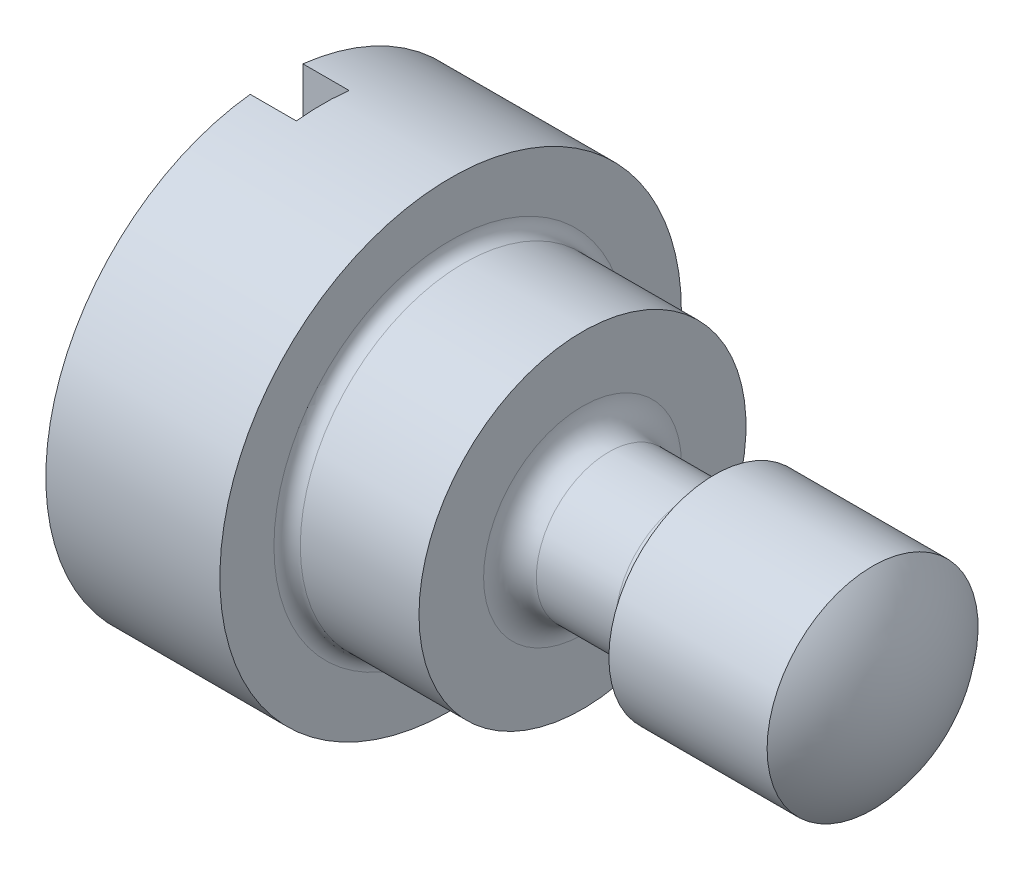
from build123d import *

# Parameters (mm, degrees)
SKETCH1_R       = 1.75
BASEHEAD_DEPTH  = 1.32
SLOT_DEPTH      = 3.848514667
SLOT_DEPTH_BACK = 3.848514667
SKETCH2_W       = 0.4
SKETCH2_H       = 0.35
FILLET1_R       = 0.1


with BuildPart() as part:
    # Sketch1 → BaseHead (new body)
    with BuildSketch(Plane(origin=(0, 0, 0), x_dir=(0, 0, -1), z_dir=(1, 0, 0))):
        Circle(SKETCH1_R)
    extrude(amount=BASEHEAD_DEPTH)

    # Sketch2 → Slot (cut, two sides: drawn at the far end of the back side and taken through both)
    with BuildSketch(Plane(origin=(0.19675588, 0, 0.19675588), x_dir=(0, 0, 1), z_dir=(0, 1, 0)).offset(-SLOT_DEPTH_BACK)):
        with Locations((-0.19675588, -0.02175588)):
            Rectangle(SKETCH2_W, SKETCH2_H)
    extrude(amount=SLOT_DEPTH + SLOT_DEPTH_BACK, mode=Mode.SUBTRACT)

    # Sketch4 → BaseBody (revolve)
    with BuildSketch(Plane.XY, mode=Mode.PRIVATE) as basebody_sk:
        with BuildLine():
            Line((1.32, 1.24), (2.32, 1.24))
            Line((2.32, 1.24), (2.32, 0.75))
            ThreePointArc((2.32, 0.75), (2.378578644, 0.608578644), (2.52, 0.55))
            Line((2.52, 0.55), (3.12, 0.55))
            ThreePointArc((3.12, 0.55), (3.261421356, 0.608578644), (3.32, 0.75))
            Line((3.32, 0.75), (3.32, 0.8))
            Line((3.32, 0.8), (4.52, 0.8))
            ThreePointArc((4.52, 0.8), (4.742533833, 0.427200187), (4.82, 0))
            Line((4.82, 0), (1.32, 0))
            Line((1.32, 0), (1.32, 1.24))
        make_face()
    revolve(basebody_sk.sketch.rotate(Axis((-0.659514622, 0, 0), (1, 0, 0)), 90), axis=Axis((-0.659514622, 0, 0), (1, 0, 0)))

    # Fillet1
    fillet1_edges = [part.edges().sort_by_distance(p)[0] for p in [
        (1.32, 0, -1.24),
    ]]
    fillet(fillet1_edges, radius=FILLET1_R)


solid = part.part
